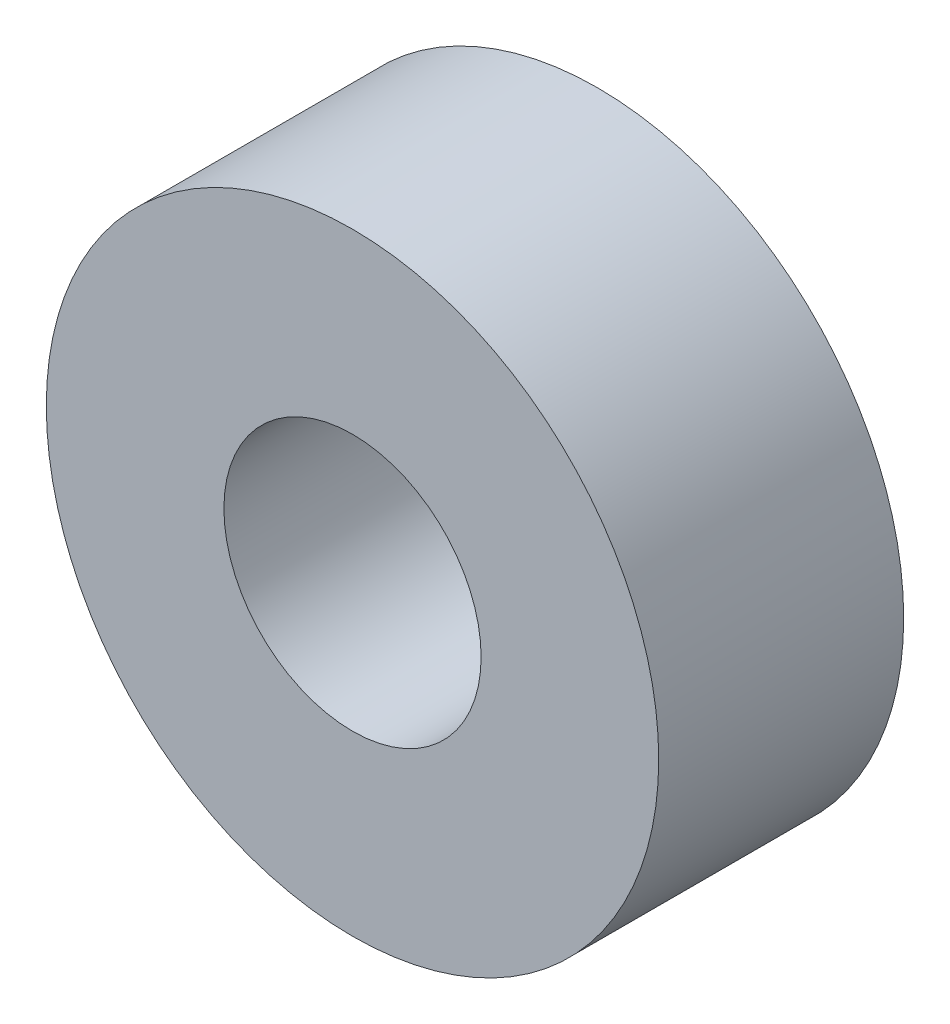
from build123d import *

# Parameters (mm, degrees)
ESQUISSE1_R        = 25
BOSS_EXTRU_1_DEPTH = 20
TROU_TARAUD_M241_D = 21


with BuildPart() as part:
    # Esquisse1 → Boss.-Extru.1 (new body)
    with BuildSketch(Plane.XY):
        Circle(ESQUISSE1_R)
    extrude(amount=BOSS_EXTRU_1_DEPTH)

    # Trou taraud_ M241 (through all)
    with Locations(Plane.XY.offset(20)):
        with Locations((0, 0)):
            Hole(TROU_TARAUD_M241_D / 2)


solid = part.part
